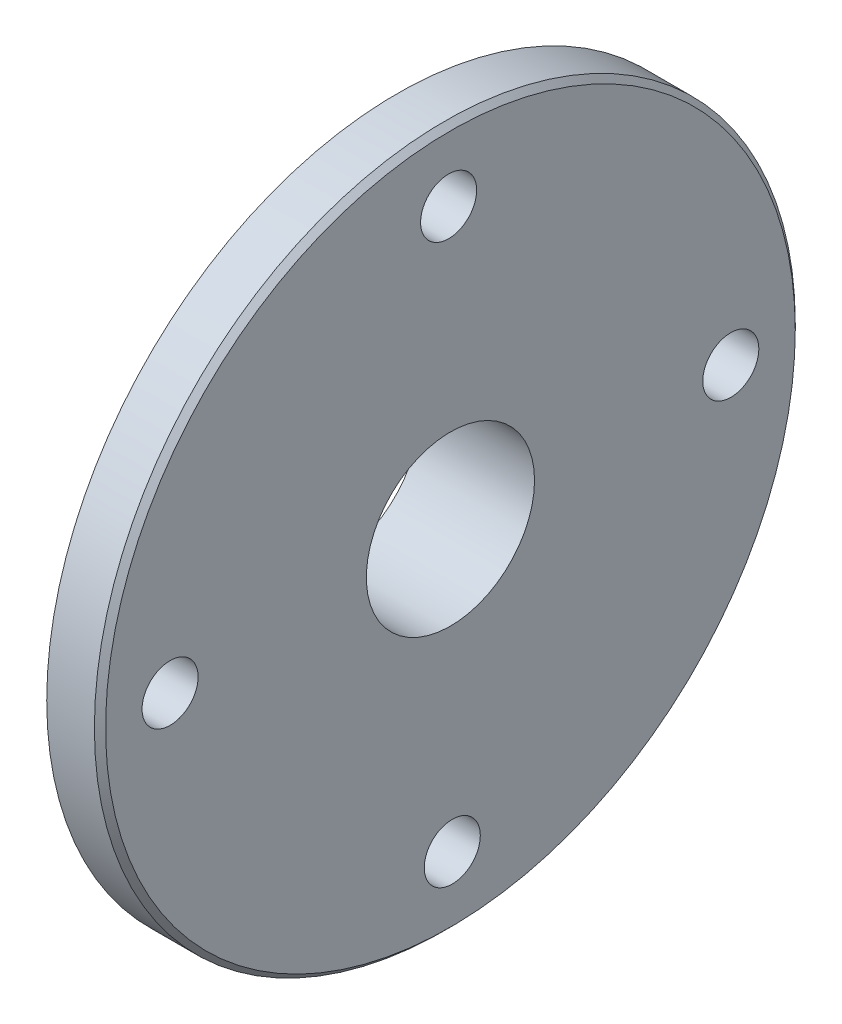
from build123d import *

# Parameters (mm, degrees)
CHANFREIN1_SIZE         = 1
ESQUISSE3_R             = 5
ENL_V_MAT_EXTRU_2_DEPTH = 90.070197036


with BuildPart() as part:
    # Esquisse1 → R_volution1 (revolve)
    with BuildSketch(Plane.XY, mode=Mode.PRIVATE) as r_volution1_sk:
        Polygon((0, 15), (0, 62.5), (-9.5, 62.5), (-9.5, 40), (-20.5, 40), (-20.5, 15), align=None)
    revolve(r_volution1_sk.sketch.rotate(Axis((0, 0, 0), (-1, 0, 0)), 90), axis=Axis((0, 0, 0), (-1, 0, 0)))

    # Chanfrein1
    chanfrein1_edges = [part.edges().sort_by_distance(p)[0] for p in [
        (0, 0, 62.5),
        (-20.5, 0, 40),
    ]]
    chamfer(chanfrein1_edges, length=CHANFREIN1_SIZE)

    # Esquisse3 → Enl_v. mat.-Extru.2 (cut, through all)
    with BuildSketch(Plane(origin=(-9.5, 0, 0), x_dir=(0, 0, -1), z_dir=(1, 0, 0))):
        with Locations((-0.325835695, 49.9989383)):
            Circle(ESQUISSE3_R)
        with Locations((49.9989383, 0.325835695)):
            Circle(ESQUISSE3_R)
        with Locations((0.325835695, -49.9989383)):
            Circle(ESQUISSE3_R)
        with Locations((-49.9989383, -0.325835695)):
            Circle(ESQUISSE3_R)
    extrude(amount=ENL_V_MAT_EXTRU_2_DEPTH, mode=Mode.SUBTRACT)


solid = part.part
